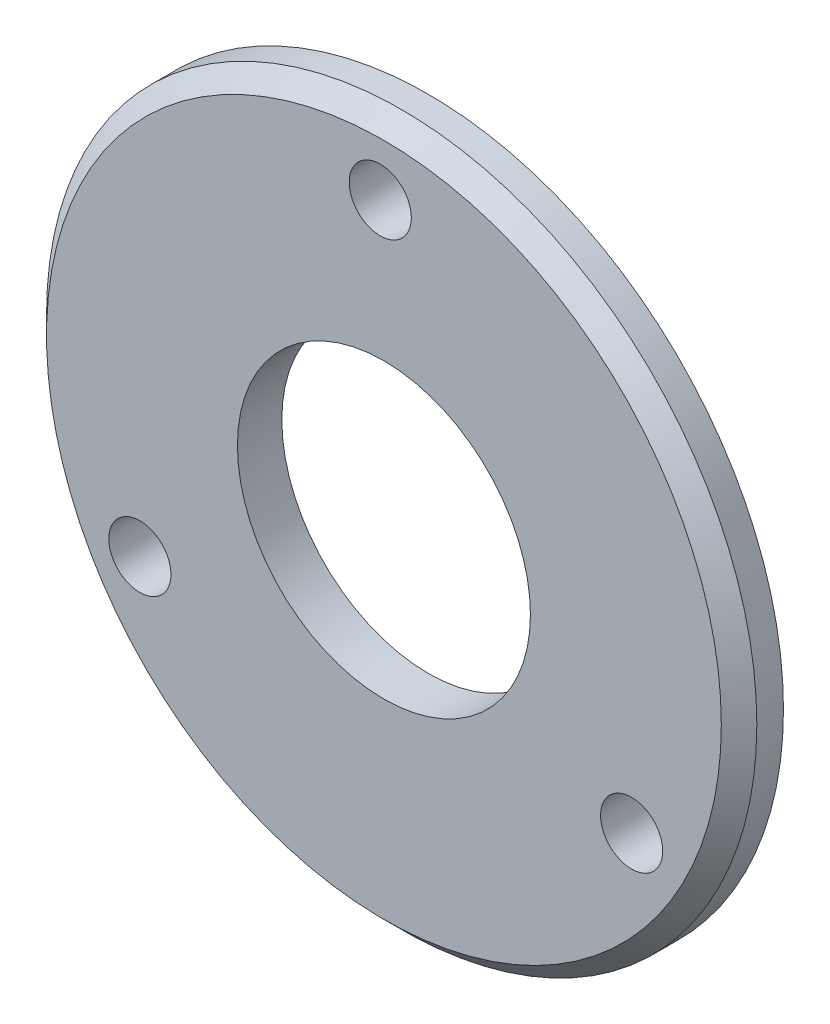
ISO-10303-21;
HEADER;
FILE_DESCRIPTION(('STEP AP214'),'2;1');
FILE_NAME('part.step','',(''),(''),'','','');
FILE_SCHEMA(('AUTOMOTIVE_DESIGN { 1 0 10303 214 1 1 1 1 }'));
ENDSEC;
DATA;
#1=APPLICATION_CONTEXT('core data for automotive mechanical design processes');
#2=APPLICATION_PROTOCOL_DEFINITION('international standard','automotive_design',2000,#1);
#3=PRODUCT_CONTEXT('',#1,'mechanical');
#4=PRODUCT('Part','Part','',(#3));
#5=PRODUCT_RELATED_PRODUCT_CATEGORY('part','',(#4));
#6=PRODUCT_DEFINITION_FORMATION('','',#4);
#7=PRODUCT_DEFINITION_CONTEXT('part definition',#1,'design');
#8=PRODUCT_DEFINITION('design','',#6,#7);
#9=PRODUCT_DEFINITION_SHAPE('','',#8);
#10=(LENGTH_UNIT() NAMED_UNIT(*) SI_UNIT(.MILLI.,.METRE.));
#11=(NAMED_UNIT(*) PLANE_ANGLE_UNIT() SI_UNIT($,.RADIAN.));
#12=(NAMED_UNIT(*) SI_UNIT($,.STERADIAN.) SOLID_ANGLE_UNIT());
#13=UNCERTAINTY_MEASURE_WITH_UNIT(LENGTH_MEASURE(1.E-05),#10,'distance_accuracy_value','');
#14=(GEOMETRIC_REPRESENTATION_CONTEXT(3) GLOBAL_UNCERTAINTY_ASSIGNED_CONTEXT((#13)) GLOBAL_UNIT_ASSIGNED_CONTEXT((#10,
#11,#12)) REPRESENTATION_CONTEXT('',''));
#15=CARTESIAN_POINT('',(0.,0.,0.));
#16=DIRECTION('',(0.,0.,1.));
#17=DIRECTION('',(1.,0.,0.));
#18=AXIS2_PLACEMENT_3D('',#15,#16,#17);
#19=CARTESIAN_POINT('',(-300.00000000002,210.710416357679,-35.4051416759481));
#20=DIRECTION('',(0.,0.,1.));
#21=DIRECTION('',(1.,0.,0.));
#22=AXIS2_PLACEMENT_3D('',#19,#20,#21);
#23=PLANE('',#22);
#24=CARTESIAN_POINT('',(-300.00000000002,210.710416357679,-35.4051416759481));
#25=DIRECTION('',(0.,0.,1.));
#26=DIRECTION('',(1.,0.,0.));
#27=AXIS2_PLACEMENT_3D('',#24,#25,#26);
#28=CIRCLE('',#27,38.0000000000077);
#29=CARTESIAN_POINT('',(-262.000000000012,210.710416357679,-35.4051416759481));
#30=VERTEX_POINT('',#29);
#31=EDGE_CURVE('E37',#30,#30,#28,.T.);
#32=ORIENTED_EDGE('',*,*,#31,.T.);
#33=EDGE_LOOP('',(#32));
#34=FACE_BOUND('',#33,.T.);
#35=CARTESIAN_POINT('',(-272.10144888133,195.078211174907,-35.4051416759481));
#36=DIRECTION('',(0.,0.,1.));
#37=DIRECTION('',(1.,0.,0.));
#38=AXIS2_PLACEMENT_3D('',#35,#36,#37);
#39=CIRCLE('',#38,3.50000000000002);
#40=CARTESIAN_POINT('',(-268.60144888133,195.078211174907,-35.4051416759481));
#41=VERTEX_POINT('',#40);
#42=EDGE_CURVE('E57',#41,#41,#39,.T.);
#43=ORIENTED_EDGE('',*,*,#42,.F.);
#44=EDGE_LOOP('',(#43));
#45=FACE_BOUND('',#44,.T.);
#46=CARTESIAN_POINT('',(-300.411388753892,242.687372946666,-35.4051416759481));
#47=DIRECTION('',(0.,0.,1.));
#48=DIRECTION('',(1.,0.,0.));
#49=AXIS2_PLACEMENT_3D('',#46,#47,#48);
#50=CIRCLE('',#49,3.50000000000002);
#51=CARTESIAN_POINT('',(-296.911388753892,242.687372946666,-35.4051416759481));
#52=VERTEX_POINT('',#51);
#53=EDGE_CURVE('E45',#52,#52,#50,.T.);
#54=ORIENTED_EDGE('',*,*,#53,.F.);
#55=EDGE_LOOP('',(#54));
#56=FACE_BOUND('',#55,.T.);
#57=CARTESIAN_POINT('',(-327.487162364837,194.365664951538,-35.4051416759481));
#58=DIRECTION('',(0.,0.,1.));
#59=DIRECTION('',(1.,0.,0.));
#60=AXIS2_PLACEMENT_3D('',#57,#58,#59);
#61=CIRCLE('',#60,3.50000000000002);
#62=CARTESIAN_POINT('',(-323.987162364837,194.365664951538,-35.4051416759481));
#63=VERTEX_POINT('',#62);
#64=EDGE_CURVE('E51',#63,#63,#61,.T.);
#65=ORIENTED_EDGE('',*,*,#64,.F.);
#66=EDGE_LOOP('',(#65));
#67=FACE_BOUND('',#66,.T.);
#68=CARTESIAN_POINT('',(-300.00000000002,210.710416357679,-35.4051416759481));
#69=DIRECTION('',(0.,0.,1.));
#70=DIRECTION('',(1.,0.,0.));
#71=AXIS2_PLACEMENT_3D('',#68,#69,#70);
#72=CIRCLE('',#71,16.5000000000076);
#73=CARTESIAN_POINT('',(-283.500000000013,210.710416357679,-35.4051416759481));
#74=VERTEX_POINT('',#73);
#75=EDGE_CURVE('E63',#74,#74,#72,.T.);
#76=ORIENTED_EDGE('',*,*,#75,.F.);
#77=EDGE_LOOP('',(#76));
#78=FACE_BOUND('',#77,.T.);
#79=ADVANCED_FACE('F30',(#34,#45,#56,#67,#78),#23,.T.);
#80=CARTESIAN_POINT('',(-300.00000000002,210.710416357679,-40.4051416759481));
#81=DIRECTION('',(0.,0.,1.));
#82=DIRECTION('',(1.,0.,0.));
#83=AXIS2_PLACEMENT_3D('',#80,#81,#82);
#84=PLANE('',#83);
#85=CARTESIAN_POINT('',(-272.10144888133,195.078211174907,-40.4051416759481));
#86=DIRECTION('',(0.,0.,1.));
#87=DIRECTION('',(1.,0.,0.));
#88=AXIS2_PLACEMENT_3D('',#85,#86,#87);
#89=CIRCLE('',#88,3.50000000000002);
#90=CARTESIAN_POINT('',(-268.60144888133,195.078211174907,-40.4051416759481));
#91=VERTEX_POINT('',#90);
#92=EDGE_CURVE('E60',#91,#91,#89,.T.);
#93=ORIENTED_EDGE('',*,*,#92,.T.);
#94=EDGE_LOOP('',(#93));
#95=FACE_BOUND('',#94,.T.);
#96=CARTESIAN_POINT('',(-300.411388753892,242.687372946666,-40.4051416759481));
#97=DIRECTION('',(0.,0.,1.));
#98=DIRECTION('',(1.,0.,0.));
#99=AXIS2_PLACEMENT_3D('',#96,#97,#98);
#100=CIRCLE('',#99,3.50000000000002);
#101=CARTESIAN_POINT('',(-296.911388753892,242.687372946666,-40.4051416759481));
#102=VERTEX_POINT('',#101);
#103=EDGE_CURVE('E48',#102,#102,#100,.T.);
#104=ORIENTED_EDGE('',*,*,#103,.T.);
#105=EDGE_LOOP('',(#104));
#106=FACE_BOUND('',#105,.T.);
#107=CARTESIAN_POINT('',(-300.00000000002,210.710416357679,-40.4051416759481));
#108=DIRECTION('',(0.,0.,1.));
#109=DIRECTION('',(1.,0.,0.));
#110=AXIS2_PLACEMENT_3D('',#107,#108,#109);
#111=CIRCLE('',#110,40.0000000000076);
#112=CARTESIAN_POINT('',(-260.000000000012,210.710416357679,-40.4051416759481));
#113=VERTEX_POINT('',#112);
#114=EDGE_CURVE('E41',#113,#113,#111,.T.);
#115=ORIENTED_EDGE('',*,*,#114,.F.);
#116=EDGE_LOOP('',(#115));
#117=FACE_BOUND('',#116,.T.);
#118=CARTESIAN_POINT('',(-327.487162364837,194.365664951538,-40.4051416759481));
#119=DIRECTION('',(0.,0.,1.));
#120=DIRECTION('',(1.,0.,0.));
#121=AXIS2_PLACEMENT_3D('',#118,#119,#120);
#122=CIRCLE('',#121,3.50000000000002);
#123=CARTESIAN_POINT('',(-323.987162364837,194.365664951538,-40.4051416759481));
#124=VERTEX_POINT('',#123);
#125=EDGE_CURVE('E54',#124,#124,#122,.T.);
#126=ORIENTED_EDGE('',*,*,#125,.T.);
#127=EDGE_LOOP('',(#126));
#128=FACE_BOUND('',#127,.T.);
#129=CARTESIAN_POINT('',(-300.00000000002,210.710416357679,-40.4051416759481));
#130=DIRECTION('',(0.,0.,1.));
#131=DIRECTION('',(1.,0.,0.));
#132=AXIS2_PLACEMENT_3D('',#129,#130,#131);
#133=CIRCLE('',#132,16.5000000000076);
#134=CARTESIAN_POINT('',(-283.500000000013,210.710416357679,-40.4051416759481));
#135=VERTEX_POINT('',#134);
#136=EDGE_CURVE('E66',#135,#135,#133,.T.);
#137=ORIENTED_EDGE('',*,*,#136,.T.);
#138=EDGE_LOOP('',(#137));
#139=FACE_BOUND('',#138,.T.);
#140=ADVANCED_FACE('F76',(#95,#106,#117,#128,#139),#84,.F.);
#141=CARTESIAN_POINT('',(-300.00000000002,210.710416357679,-35.4051416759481));
#142=DIRECTION('',(0.,0.,-1.));
#143=DIRECTION('',(-1.,0.,0.));
#144=AXIS2_PLACEMENT_3D('',#141,#142,#143);
#145=CYLINDRICAL_SURFACE('',#144,40.0000000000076);
#146=CARTESIAN_POINT('',(-300.00000000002,210.710416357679,-37.4051416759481));
#147=DIRECTION('',(0.,0.,1.));
#148=DIRECTION('',(1.,0.,0.));
#149=AXIS2_PLACEMENT_3D('',#146,#147,#148);
#150=CIRCLE('',#149,40.0000000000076);
#151=CARTESIAN_POINT('',(-260.000000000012,210.710416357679,-37.4051416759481));
#152=VERTEX_POINT('',#151);
#153=EDGE_CURVE('E10',#152,#152,#150,.F.);
#154=ORIENTED_EDGE('',*,*,#153,.T.);
#155=EDGE_LOOP('',(#154));
#156=FACE_BOUND('',#155,.T.);
#157=ORIENTED_EDGE('',*,*,#114,.T.);
#158=EDGE_LOOP('',(#157));
#159=FACE_BOUND('',#158,.T.);
#160=ADVANCED_FACE('F81',(#156,#159),#145,.T.);
#161=CARTESIAN_POINT('',(-300.411388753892,242.687372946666,-35.4051416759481));
#162=DIRECTION('',(0.,0.,-1.));
#163=DIRECTION('',(-1.,0.,0.));
#164=AXIS2_PLACEMENT_3D('',#161,#162,#163);
#165=CYLINDRICAL_SURFACE('',#164,3.50000000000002);
#166=ORIENTED_EDGE('',*,*,#53,.T.);
#167=EDGE_LOOP('',(#166));
#168=FACE_BOUND('',#167,.T.);
#169=ORIENTED_EDGE('',*,*,#103,.F.);
#170=EDGE_LOOP('',(#169));
#171=FACE_BOUND('',#170,.T.);
#172=ADVANCED_FACE('F86',(#168,#171),#165,.F.);
#173=CARTESIAN_POINT('',(-327.487162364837,194.365664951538,-35.4051416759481));
#174=DIRECTION('',(0.,0.,-1.));
#175=DIRECTION('',(-1.,0.,0.));
#176=AXIS2_PLACEMENT_3D('',#173,#174,#175);
#177=CYLINDRICAL_SURFACE('',#176,3.50000000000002);
#178=ORIENTED_EDGE('',*,*,#64,.T.);
#179=EDGE_LOOP('',(#178));
#180=FACE_BOUND('',#179,.T.);
#181=ORIENTED_EDGE('',*,*,#125,.F.);
#182=EDGE_LOOP('',(#181));
#183=FACE_BOUND('',#182,.T.);
#184=ADVANCED_FACE('F92',(#180,#183),#177,.F.);
#185=CARTESIAN_POINT('',(-272.10144888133,195.078211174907,-35.4051416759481));
#186=DIRECTION('',(0.,0.,-1.));
#187=DIRECTION('',(-1.,0.,0.));
#188=AXIS2_PLACEMENT_3D('',#185,#186,#187);
#189=CYLINDRICAL_SURFACE('',#188,3.50000000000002);
#190=ORIENTED_EDGE('',*,*,#42,.T.);
#191=EDGE_LOOP('',(#190));
#192=FACE_BOUND('',#191,.T.);
#193=ORIENTED_EDGE('',*,*,#92,.F.);
#194=EDGE_LOOP('',(#193));
#195=FACE_BOUND('',#194,.T.);
#196=ADVANCED_FACE('F102',(#192,#195),#189,.F.);
#197=CARTESIAN_POINT('',(-300.00000000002,210.710416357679,-35.4051416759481));
#198=DIRECTION('',(0.,0.,-1.));
#199=DIRECTION('',(-1.,0.,0.));
#200=AXIS2_PLACEMENT_3D('',#197,#198,#199);
#201=CYLINDRICAL_SURFACE('',#200,16.5000000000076);
#202=ORIENTED_EDGE('',*,*,#75,.T.);
#203=EDGE_LOOP('',(#202));
#204=FACE_BOUND('',#203,.T.);
#205=ORIENTED_EDGE('',*,*,#136,.F.);
#206=EDGE_LOOP('',(#205));
#207=FACE_BOUND('',#206,.T.);
#208=ADVANCED_FACE('F72',(#204,#207),#201,.F.);
#209=CARTESIAN_POINT('',(-300.00000000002,210.710416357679,-35.4051416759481));
#210=DIRECTION('',(0.,0.,-1.));
#211=DIRECTION('',(-1.,0.,0.));
#212=AXIS2_PLACEMENT_3D('',#209,#210,#211);
#213=CONICAL_SURFACE('',#212,38.0000000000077,0.785398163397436);
#214=ORIENTED_EDGE('',*,*,#153,.F.);
#215=EDGE_LOOP('',(#214));
#216=FACE_BOUND('',#215,.T.);
#217=ORIENTED_EDGE('',*,*,#31,.F.);
#218=EDGE_LOOP('',(#217));
#219=FACE_BOUND('',#218,.T.);
#220=ADVANCED_FACE('F32',(#216,#219),#213,.T.);
#221=CLOSED_SHELL('',(#79,#140,#160,#172,#184,#196,#208,#220));
#222=MANIFOLD_SOLID_BREP('B2',#221);
#223=ADVANCED_BREP_SHAPE_REPRESENTATION('',(#18,#222),#14);
#224=SHAPE_DEFINITION_REPRESENTATION(#9,#223);
ENDSEC;
END-ISO-10303-21;
